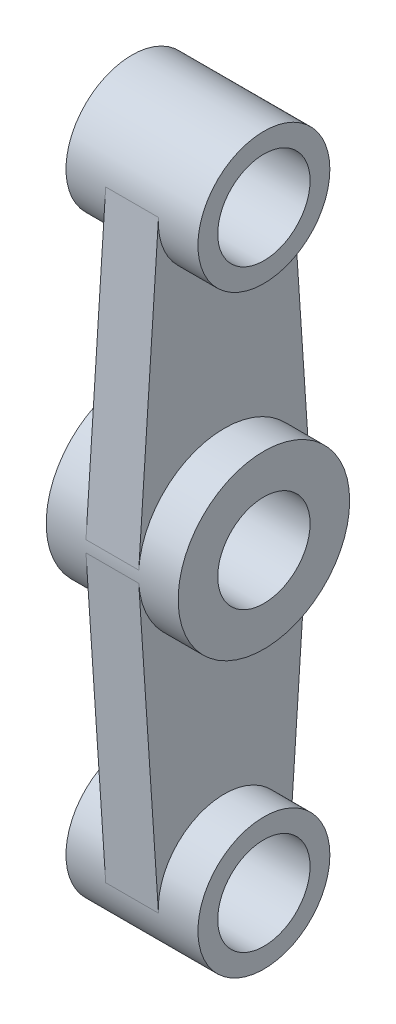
ISO-10303-21;
HEADER;
FILE_DESCRIPTION(('STEP AP214'),'2;1');
FILE_NAME('part.step','',(''),(''),'','','');
FILE_SCHEMA(('AUTOMOTIVE_DESIGN { 1 0 10303 214 1 1 1 1 }'));
ENDSEC;
DATA;
#1=APPLICATION_CONTEXT('core data for automotive mechanical design processes');
#2=APPLICATION_PROTOCOL_DEFINITION('international standard','automotive_design',2000,#1);
#3=PRODUCT_CONTEXT('',#1,'mechanical');
#4=PRODUCT('Part','Part','',(#3));
#5=PRODUCT_RELATED_PRODUCT_CATEGORY('part','',(#4));
#6=PRODUCT_DEFINITION_FORMATION('','',#4);
#7=PRODUCT_DEFINITION_CONTEXT('part definition',#1,'design');
#8=PRODUCT_DEFINITION('design','',#6,#7);
#9=PRODUCT_DEFINITION_SHAPE('','',#8);
#10=(LENGTH_UNIT() NAMED_UNIT(*) SI_UNIT(.MILLI.,.METRE.));
#11=(NAMED_UNIT(*) PLANE_ANGLE_UNIT() SI_UNIT($,.RADIAN.));
#12=(NAMED_UNIT(*) SI_UNIT($,.STERADIAN.) SOLID_ANGLE_UNIT());
#13=UNCERTAINTY_MEASURE_WITH_UNIT(LENGTH_MEASURE(1.E-05),#10,'distance_accuracy_value','');
#14=(GEOMETRIC_REPRESENTATION_CONTEXT(3) GLOBAL_UNCERTAINTY_ASSIGNED_CONTEXT((#13)) GLOBAL_UNIT_ASSIGNED_CONTEXT((#10,
#11,#12)) REPRESENTATION_CONTEXT('',''));
#15=CARTESIAN_POINT('',(0.,0.,0.));
#16=DIRECTION('',(0.,0.,1.));
#17=DIRECTION('',(1.,0.,0.));
#18=AXIS2_PLACEMENT_3D('',#15,#16,#17);
#19=CARTESIAN_POINT('',(10.,-2.16666666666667,32.4276973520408));
#20=DIRECTION('',(0.,0.0666666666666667,-0.997775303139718));
#21=DIRECTION('',(0.,0.997775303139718,0.0666666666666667));
#22=AXIS2_PLACEMENT_3D('',#19,#20,#21);
#23=PLANE('',#22);
#24=DIRECTION('',(0.,-0.997775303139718,-0.0666666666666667));
#25=VECTOR('',#24,1.);
#26=CARTESIAN_POINT('',(-10.,-2.16666666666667,32.4276973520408));
#27=LINE('',#26,#25);
#28=CARTESIAN_POINT('',(-10.,-2.16666666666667,32.4276973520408));
#29=VERTEX_POINT('',#28);
#30=CARTESIAN_POINT('',(-10.,-114.166666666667,24.9443825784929));
#31=VERTEX_POINT('',#30);
#32=EDGE_CURVE('E110',#29,#31,#27,.T.);
#33=ORIENTED_EDGE('',*,*,#32,.T.);
#34=DIRECTION('',(-1.,0.,0.));
#35=VECTOR('',#34,1.);
#36=CARTESIAN_POINT('',(10.,-114.166666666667,24.9443825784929));
#37=LINE('',#36,#35);
#38=CARTESIAN_POINT('',(10.,-114.166666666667,24.9443825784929));
#39=VERTEX_POINT('',#38);
#40=EDGE_CURVE('E44',#39,#31,#37,.T.);
#41=ORIENTED_EDGE('',*,*,#40,.F.);
#42=DIRECTION('',(0.,-0.997775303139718,-0.0666666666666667));
#43=VECTOR('',#42,1.);
#44=CARTESIAN_POINT('',(10.,-2.16666666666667,32.4276973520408));
#45=LINE('',#44,#43);
#46=CARTESIAN_POINT('',(10.,-2.16666666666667,32.4276973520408));
#47=VERTEX_POINT('',#46);
#48=EDGE_CURVE('E126',#47,#39,#45,.T.);
#49=ORIENTED_EDGE('',*,*,#48,.F.);
#50=DIRECTION('',(-1.,0.,0.));
#51=VECTOR('',#50,1.);
#52=CARTESIAN_POINT('',(10.,-2.16666666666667,32.4276973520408));
#53=LINE('',#52,#51);
#54=EDGE_CURVE('E11',#47,#29,#53,.T.);
#55=ORIENTED_EDGE('',*,*,#54,.T.);
#56=EDGE_LOOP('',(#33,#41,#49,#55));
#57=FACE_BOUND('',#56,.T.);
#58=ADVANCED_FACE('F37',(#57),#23,.F.);
#59=CARTESIAN_POINT('',(10.,-2.16666666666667,-32.4276973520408));
#60=DIRECTION('',(0.,-0.0666666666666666,-0.997775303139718));
#61=DIRECTION('',(0.,0.997775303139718,-0.0666666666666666));
#62=AXIS2_PLACEMENT_3D('',#59,#60,#61);
#63=PLANE('',#62);
#64=DIRECTION('',(0.,-0.997775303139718,0.0666666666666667));
#65=VECTOR('',#64,1.);
#66=CARTESIAN_POINT('',(-10.,-2.16666666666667,-32.4276973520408));
#67=LINE('',#66,#65);
#68=CARTESIAN_POINT('',(-10.,-2.16666666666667,-32.4276973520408));
#69=VERTEX_POINT('',#68);
#70=CARTESIAN_POINT('',(-10.,-114.166666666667,-24.944382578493));
#71=VERTEX_POINT('',#70);
#72=EDGE_CURVE('E109',#69,#71,#67,.T.);
#73=ORIENTED_EDGE('',*,*,#72,.F.);
#74=DIRECTION('',(-1.,0.,0.));
#75=VECTOR('',#74,1.);
#76=CARTESIAN_POINT('',(10.,-2.16666666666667,-32.4276973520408));
#77=LINE('',#76,#75);
#78=CARTESIAN_POINT('',(10.,-2.16666666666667,-32.4276973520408));
#79=VERTEX_POINT('',#78);
#80=EDGE_CURVE('E119',#79,#69,#77,.T.);
#81=ORIENTED_EDGE('',*,*,#80,.F.);
#82=DIRECTION('',(0.,-0.997775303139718,0.0666666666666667));
#83=VECTOR('',#82,1.);
#84=CARTESIAN_POINT('',(10.,-2.16666666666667,-32.4276973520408));
#85=LINE('',#84,#83);
#86=CARTESIAN_POINT('',(10.,-114.166666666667,-24.9443825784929));
#87=VERTEX_POINT('',#86);
#88=EDGE_CURVE('E118',#79,#87,#85,.T.);
#89=ORIENTED_EDGE('',*,*,#88,.T.);
#90=DIRECTION('',(-1.,0.,0.));
#91=VECTOR('',#90,1.);
#92=CARTESIAN_POINT('',(10.,-114.166666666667,-24.944382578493));
#93=LINE('',#92,#91);
#94=EDGE_CURVE('E102',#87,#71,#93,.T.);
#95=ORIENTED_EDGE('',*,*,#94,.T.);
#96=EDGE_LOOP('',(#73,#81,#89,#95));
#97=FACE_BOUND('',#96,.T.);
#98=ADVANCED_FACE('F115',(#97),#63,.T.);
#99=CARTESIAN_POINT('',(10.,0.,0.));
#100=DIRECTION('',(1.,0.,0.));
#101=DIRECTION('',(0.,0.,-1.));
#102=AXIS2_PLACEMENT_3D('',#99,#100,#101);
#103=PLANE('',#102);
#104=CARTESIAN_POINT('',(10.,0.,0.));
#105=DIRECTION('',(1.,0.,0.));
#106=DIRECTION('',(0.,0.,-1.));
#107=AXIS2_PLACEMENT_3D('',#104,#105,#106);
#108=CIRCLE('',#107,32.5);
#109=EDGE_CURVE('E124',#47,#79,#108,.T.);
#110=ORIENTED_EDGE('',*,*,#109,.F.);
#111=ORIENTED_EDGE('',*,*,#48,.T.);
#112=CARTESIAN_POINT('',(10.,-112.5,0.));
#113=DIRECTION('',(1.,0.,0.));
#114=DIRECTION('',(0.,0.,-1.));
#115=AXIS2_PLACEMENT_3D('',#112,#113,#114);
#116=CIRCLE('',#115,25.);
#117=EDGE_CURVE('E131',#87,#39,#116,.T.);
#118=ORIENTED_EDGE('',*,*,#117,.F.);
#119=ORIENTED_EDGE('',*,*,#88,.F.);
#120=EDGE_LOOP('',(#110,#111,#118,#119));
#121=FACE_BOUND('',#120,.T.);
#122=ADVANCED_FACE('F144',(#121),#103,.T.);
#123=CARTESIAN_POINT('',(-10.,0.,0.));
#124=DIRECTION('',(1.,0.,0.));
#125=DIRECTION('',(0.,0.,-1.));
#126=AXIS2_PLACEMENT_3D('',#123,#124,#125);
#127=PLANE('',#126);
#128=CARTESIAN_POINT('',(-10.,0.,0.));
#129=DIRECTION('',(1.,0.,0.));
#130=DIRECTION('',(0.,0.,-1.));
#131=AXIS2_PLACEMENT_3D('',#128,#129,#130);
#132=CIRCLE('',#131,32.5);
#133=EDGE_CURVE('E123',#29,#69,#132,.T.);
#134=ORIENTED_EDGE('',*,*,#133,.T.);
#135=ORIENTED_EDGE('',*,*,#72,.T.);
#136=CARTESIAN_POINT('',(-10.,-112.5,0.));
#137=DIRECTION('',(1.,0.,0.));
#138=DIRECTION('',(0.,0.,-1.));
#139=AXIS2_PLACEMENT_3D('',#136,#137,#138);
#140=CIRCLE('',#139,25.);
#141=EDGE_CURVE('E98',#71,#31,#140,.T.);
#142=ORIENTED_EDGE('',*,*,#141,.T.);
#143=ORIENTED_EDGE('',*,*,#32,.F.);
#144=EDGE_LOOP('',(#134,#135,#142,#143));
#145=FACE_BOUND('',#144,.T.);
#146=ADVANCED_FACE('F122',(#145),#127,.F.);
#147=CARTESIAN_POINT('',(25.,0.,0.));
#148=DIRECTION('',(-1.,0.,0.));
#149=DIRECTION('',(0.,0.,1.));
#150=AXIS2_PLACEMENT_3D('',#147,#148,#149);
#151=CYLINDRICAL_SURFACE('',#150,17.5);
#152=CARTESIAN_POINT('',(25.,0.,0.));
#153=DIRECTION('',(1.,0.,0.));
#154=DIRECTION('',(0.,0.,-1.));
#155=AXIS2_PLACEMENT_3D('',#152,#153,#154);
#156=CIRCLE('',#155,17.5);
#157=CARTESIAN_POINT('',(25.,0.,-17.5));
#158=VERTEX_POINT('',#157);
#159=EDGE_CURVE('E149',#158,#158,#156,.T.);
#160=ORIENTED_EDGE('',*,*,#159,.T.);
#161=EDGE_LOOP('',(#160));
#162=FACE_BOUND('',#161,.T.);
#163=CARTESIAN_POINT('',(-25.,0.,0.));
#164=DIRECTION('',(1.,0.,0.));
#165=DIRECTION('',(0.,0.,-1.));
#166=AXIS2_PLACEMENT_3D('',#163,#164,#165);
#167=CIRCLE('',#166,17.5);
#168=CARTESIAN_POINT('',(-25.,0.,-17.5));
#169=VERTEX_POINT('',#168);
#170=EDGE_CURVE('E150',#169,#169,#167,.T.);
#171=ORIENTED_EDGE('',*,*,#170,.F.);
#172=EDGE_LOOP('',(#171));
#173=FACE_BOUND('',#172,.T.);
#174=ADVANCED_FACE('F242',(#162,#173),#151,.F.);
#175=CARTESIAN_POINT('',(25.,0.,0.));
#176=DIRECTION('',(-1.,0.,0.));
#177=DIRECTION('',(0.,0.,1.));
#178=AXIS2_PLACEMENT_3D('',#175,#176,#177);
#179=CYLINDRICAL_SURFACE('',#178,32.5);
#180=DIRECTION('',(-1.,0.,0.));
#181=VECTOR('',#180,1.);
#182=CARTESIAN_POINT('',(10.,2.16666666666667,-32.4276973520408));
#183=LINE('',#182,#181);
#184=CARTESIAN_POINT('',(10.,2.16666666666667,-32.4276973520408));
#185=VERTEX_POINT('',#184);
#186=CARTESIAN_POINT('',(-10.,2.16666666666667,-32.4276973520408));
#187=VERTEX_POINT('',#186);
#188=EDGE_CURVE('E51',#185,#187,#183,.T.);
#189=ORIENTED_EDGE('',*,*,#188,.F.);
#190=CARTESIAN_POINT('',(10.,0.,0.));
#191=DIRECTION('',(1.,0.,0.));
#192=DIRECTION('',(0.,0.,-1.));
#193=AXIS2_PLACEMENT_3D('',#190,#191,#192);
#194=CIRCLE('',#193,32.5);
#195=CARTESIAN_POINT('',(10.,2.16666666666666,32.4276973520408));
#196=VERTEX_POINT('',#195);
#197=EDGE_CURVE('E55',#185,#196,#194,.T.);
#198=ORIENTED_EDGE('',*,*,#197,.T.);
#199=DIRECTION('',(-1.,0.,0.));
#200=VECTOR('',#199,1.);
#201=CARTESIAN_POINT('',(10.,2.16666666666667,32.4276973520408));
#202=LINE('',#201,#200);
#203=CARTESIAN_POINT('',(-10.,2.16666666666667,32.4276973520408));
#204=VERTEX_POINT('',#203);
#205=EDGE_CURVE('E163',#196,#204,#202,.T.);
#206=ORIENTED_EDGE('',*,*,#205,.T.);
#207=CARTESIAN_POINT('',(-10.,0.,0.));
#208=DIRECTION('',(1.,0.,0.));
#209=DIRECTION('',(0.,0.,-1.));
#210=AXIS2_PLACEMENT_3D('',#207,#208,#209);
#211=CIRCLE('',#210,32.5);
#212=EDGE_CURVE('E175',#187,#204,#211,.T.);
#213=ORIENTED_EDGE('',*,*,#212,.F.);
#214=EDGE_LOOP('',(#189,#198,#206,#213));
#215=FACE_BOUND('',#214,.T.);
#216=ORIENTED_EDGE('',*,*,#109,.T.);
#217=ORIENTED_EDGE('',*,*,#80,.T.);
#218=ORIENTED_EDGE('',*,*,#133,.F.);
#219=ORIENTED_EDGE('',*,*,#54,.F.);
#220=EDGE_LOOP('',(#216,#217,#218,#219));
#221=FACE_BOUND('',#220,.T.);
#222=CARTESIAN_POINT('',(25.,0.,0.));
#223=DIRECTION('',(1.,0.,0.));
#224=DIRECTION('',(0.,0.,-1.));
#225=AXIS2_PLACEMENT_3D('',#222,#223,#224);
#226=CIRCLE('',#225,32.5);
#227=CARTESIAN_POINT('',(25.,0.,-32.5));
#228=VERTEX_POINT('',#227);
#229=EDGE_CURVE('E136',#228,#228,#226,.T.);
#230=ORIENTED_EDGE('',*,*,#229,.F.);
#231=EDGE_LOOP('',(#230));
#232=FACE_BOUND('',#231,.T.);
#233=CARTESIAN_POINT('',(-25.,0.,0.));
#234=DIRECTION('',(1.,0.,0.));
#235=DIRECTION('',(0.,0.,-1.));
#236=AXIS2_PLACEMENT_3D('',#233,#234,#235);
#237=CIRCLE('',#236,32.5);
#238=CARTESIAN_POINT('',(-25.,0.,-32.5));
#239=VERTEX_POINT('',#238);
#240=EDGE_CURVE('E146',#239,#239,#237,.T.);
#241=ORIENTED_EDGE('',*,*,#240,.T.);
#242=EDGE_LOOP('',(#241));
#243=FACE_BOUND('',#242,.T.);
#244=ADVANCED_FACE('F141',(#215,#221,#232,#243),#179,.T.);
#245=CARTESIAN_POINT('',(25.,0.,0.));
#246=DIRECTION('',(1.,0.,0.));
#247=DIRECTION('',(0.,0.,-1.));
#248=AXIS2_PLACEMENT_3D('',#245,#246,#247);
#249=PLANE('',#248);
#250=ORIENTED_EDGE('',*,*,#159,.F.);
#251=EDGE_LOOP('',(#250));
#252=FACE_BOUND('',#251,.T.);
#253=ORIENTED_EDGE('',*,*,#229,.T.);
#254=EDGE_LOOP('',(#253));
#255=FACE_BOUND('',#254,.T.);
#256=ADVANCED_FACE('F249',(#252,#255),#249,.T.);
#257=CARTESIAN_POINT('',(-25.,0.,0.));
#258=DIRECTION('',(1.,0.,0.));
#259=DIRECTION('',(0.,0.,-1.));
#260=AXIS2_PLACEMENT_3D('',#257,#258,#259);
#261=PLANE('',#260);
#262=ORIENTED_EDGE('',*,*,#170,.T.);
#263=EDGE_LOOP('',(#262));
#264=FACE_BOUND('',#263,.T.);
#265=ORIENTED_EDGE('',*,*,#240,.F.);
#266=EDGE_LOOP('',(#265));
#267=FACE_BOUND('',#266,.T.);
#268=ADVANCED_FACE('F250',(#264,#267),#261,.F.);
#269=CARTESIAN_POINT('',(10.,2.16666666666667,-32.4276973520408));
#270=DIRECTION('',(0.,0.0666666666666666,-0.997775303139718));
#271=DIRECTION('',(0.,0.997775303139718,0.0666666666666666));
#272=AXIS2_PLACEMENT_3D('',#269,#270,#271);
#273=PLANE('',#272);
#274=DIRECTION('',(0.,-0.997775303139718,-0.0666666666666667));
#275=VECTOR('',#274,1.);
#276=CARTESIAN_POINT('',(-10.,2.16666666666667,-32.4276973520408));
#277=LINE('',#276,#275);
#278=CARTESIAN_POINT('',(-10.,114.166666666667,-24.944382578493));
#279=VERTEX_POINT('',#278);
#280=EDGE_CURVE('E172',#279,#187,#277,.T.);
#281=ORIENTED_EDGE('',*,*,#280,.F.);
#282=DIRECTION('',(-1.,0.,0.));
#283=VECTOR('',#282,1.);
#284=CARTESIAN_POINT('',(10.,114.166666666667,-24.944382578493));
#285=LINE('',#284,#283);
#286=CARTESIAN_POINT('',(10.,114.166666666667,-24.9443825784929));
#287=VERTEX_POINT('',#286);
#288=EDGE_CURVE('E158',#287,#279,#285,.T.);
#289=ORIENTED_EDGE('',*,*,#288,.F.);
#290=DIRECTION('',(0.,-0.997775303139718,-0.0666666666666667));
#291=VECTOR('',#290,1.);
#292=CARTESIAN_POINT('',(10.,2.16666666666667,-32.4276973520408));
#293=LINE('',#292,#291);
#294=EDGE_CURVE('E182',#287,#185,#293,.T.);
#295=ORIENTED_EDGE('',*,*,#294,.T.);
#296=ORIENTED_EDGE('',*,*,#188,.T.);
#297=EDGE_LOOP('',(#281,#289,#295,#296));
#298=FACE_BOUND('',#297,.T.);
#299=ADVANCED_FACE('F253',(#298),#273,.T.);
#300=CARTESIAN_POINT('',(10.,2.16666666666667,32.4276973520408));
#301=DIRECTION('',(0.,-0.0666666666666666,-0.997775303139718));
#302=DIRECTION('',(0.,0.997775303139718,-0.0666666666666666));
#303=AXIS2_PLACEMENT_3D('',#300,#301,#302);
#304=PLANE('',#303);
#305=DIRECTION('',(0.,-0.997775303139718,0.0666666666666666));
#306=VECTOR('',#305,1.);
#307=CARTESIAN_POINT('',(-10.,2.16666666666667,32.4276973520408));
#308=LINE('',#307,#306);
#309=CARTESIAN_POINT('',(-10.,114.166666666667,24.944382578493));
#310=VERTEX_POINT('',#309);
#311=EDGE_CURVE('E166',#310,#204,#308,.T.);
#312=ORIENTED_EDGE('',*,*,#311,.T.);
#313=ORIENTED_EDGE('',*,*,#205,.F.);
#314=DIRECTION('',(0.,-0.997775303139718,0.0666666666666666));
#315=VECTOR('',#314,1.);
#316=CARTESIAN_POINT('',(10.,2.16666666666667,32.4276973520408));
#317=LINE('',#316,#315);
#318=CARTESIAN_POINT('',(10.,114.166666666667,24.944382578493));
#319=VERTEX_POINT('',#318);
#320=EDGE_CURVE('E165',#319,#196,#317,.T.);
#321=ORIENTED_EDGE('',*,*,#320,.F.);
#322=DIRECTION('',(-1.,0.,0.));
#323=VECTOR('',#322,1.);
#324=CARTESIAN_POINT('',(10.,114.166666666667,24.944382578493));
#325=LINE('',#324,#323);
#326=EDGE_CURVE('E160',#319,#310,#325,.T.);
#327=ORIENTED_EDGE('',*,*,#326,.T.);
#328=EDGE_LOOP('',(#312,#313,#321,#327));
#329=FACE_BOUND('',#328,.T.);
#330=ADVANCED_FACE('F260',(#329),#304,.F.);
#331=CARTESIAN_POINT('',(10.,0.,0.));
#332=DIRECTION('',(1.,0.,0.));
#333=DIRECTION('',(0.,0.,-1.));
#334=AXIS2_PLACEMENT_3D('',#331,#332,#333);
#335=PLANE('',#334);
#336=ORIENTED_EDGE('',*,*,#197,.F.);
#337=ORIENTED_EDGE('',*,*,#294,.F.);
#338=CARTESIAN_POINT('',(10.,112.5,0.));
#339=DIRECTION('',(1.,0.,0.));
#340=DIRECTION('',(0.,0.,-1.));
#341=AXIS2_PLACEMENT_3D('',#338,#339,#340);
#342=CIRCLE('',#341,25.);
#343=EDGE_CURVE('E180',#319,#287,#342,.T.);
#344=ORIENTED_EDGE('',*,*,#343,.F.);
#345=ORIENTED_EDGE('',*,*,#320,.T.);
#346=EDGE_LOOP('',(#336,#337,#344,#345));
#347=FACE_BOUND('',#346,.T.);
#348=ADVANCED_FACE('F264',(#347),#335,.T.);
#349=CARTESIAN_POINT('',(-10.,0.,0.));
#350=DIRECTION('',(1.,0.,0.));
#351=DIRECTION('',(0.,0.,-1.));
#352=AXIS2_PLACEMENT_3D('',#349,#350,#351);
#353=PLANE('',#352);
#354=ORIENTED_EDGE('',*,*,#212,.T.);
#355=ORIENTED_EDGE('',*,*,#311,.F.);
#356=CARTESIAN_POINT('',(-10.,112.5,0.));
#357=DIRECTION('',(1.,0.,0.));
#358=DIRECTION('',(0.,0.,-1.));
#359=AXIS2_PLACEMENT_3D('',#356,#357,#358);
#360=CIRCLE('',#359,25.);
#361=EDGE_CURVE('E169',#310,#279,#360,.T.);
#362=ORIENTED_EDGE('',*,*,#361,.T.);
#363=ORIENTED_EDGE('',*,*,#280,.T.);
#364=EDGE_LOOP('',(#354,#355,#362,#363));
#365=FACE_BOUND('',#364,.T.);
#366=ADVANCED_FACE('F266',(#365),#353,.F.);
#367=CARTESIAN_POINT('',(25.,112.5,0.));
#368=DIRECTION('',(-1.,0.,0.));
#369=DIRECTION('',(0.,0.,1.));
#370=AXIS2_PLACEMENT_3D('',#367,#368,#369);
#371=CYLINDRICAL_SURFACE('',#370,17.5);
#372=CARTESIAN_POINT('',(25.,112.5,0.));
#373=DIRECTION('',(1.,0.,0.));
#374=DIRECTION('',(0.,0.,-1.));
#375=AXIS2_PLACEMENT_3D('',#372,#373,#374);
#376=CIRCLE('',#375,17.5);
#377=CARTESIAN_POINT('',(25.,112.5,-17.5));
#378=VERTEX_POINT('',#377);
#379=EDGE_CURVE('E189',#378,#378,#376,.T.);
#380=ORIENTED_EDGE('',*,*,#379,.T.);
#381=EDGE_LOOP('',(#380));
#382=FACE_BOUND('',#381,.T.);
#383=CARTESIAN_POINT('',(-25.,112.5,0.));
#384=DIRECTION('',(1.,0.,0.));
#385=DIRECTION('',(0.,0.,-1.));
#386=AXIS2_PLACEMENT_3D('',#383,#384,#385);
#387=CIRCLE('',#386,17.5);
#388=CARTESIAN_POINT('',(-25.,112.5,-17.5));
#389=VERTEX_POINT('',#388);
#390=EDGE_CURVE('E190',#389,#389,#387,.T.);
#391=ORIENTED_EDGE('',*,*,#390,.F.);
#392=EDGE_LOOP('',(#391));
#393=FACE_BOUND('',#392,.T.);
#394=ADVANCED_FACE('F269',(#382,#393),#371,.F.);
#395=CARTESIAN_POINT('',(25.,112.5,0.));
#396=DIRECTION('',(-1.,0.,0.));
#397=DIRECTION('',(0.,0.,1.));
#398=AXIS2_PLACEMENT_3D('',#395,#396,#397);
#399=CYLINDRICAL_SURFACE('',#398,25.);
#400=ORIENTED_EDGE('',*,*,#343,.T.);
#401=ORIENTED_EDGE('',*,*,#288,.T.);
#402=ORIENTED_EDGE('',*,*,#361,.F.);
#403=ORIENTED_EDGE('',*,*,#326,.F.);
#404=EDGE_LOOP('',(#400,#401,#402,#403));
#405=FACE_BOUND('',#404,.T.);
#406=CARTESIAN_POINT('',(25.,112.5,0.));
#407=DIRECTION('',(1.,0.,0.));
#408=DIRECTION('',(0.,0.,-1.));
#409=AXIS2_PLACEMENT_3D('',#406,#407,#408);
#410=CIRCLE('',#409,25.);
#411=CARTESIAN_POINT('',(25.,112.5,-25.));
#412=VERTEX_POINT('',#411);
#413=EDGE_CURVE('E178',#412,#412,#410,.T.);
#414=ORIENTED_EDGE('',*,*,#413,.F.);
#415=EDGE_LOOP('',(#414));
#416=FACE_BOUND('',#415,.T.);
#417=CARTESIAN_POINT('',(-25.,112.5,0.));
#418=DIRECTION('',(1.,0.,0.));
#419=DIRECTION('',(0.,0.,-1.));
#420=AXIS2_PLACEMENT_3D('',#417,#418,#419);
#421=CIRCLE('',#420,25.);
#422=CARTESIAN_POINT('',(-25.,112.5,-25.));
#423=VERTEX_POINT('',#422);
#424=EDGE_CURVE('E186',#423,#423,#421,.T.);
#425=ORIENTED_EDGE('',*,*,#424,.T.);
#426=EDGE_LOOP('',(#425));
#427=FACE_BOUND('',#426,.T.);
#428=ADVANCED_FACE('F276',(#405,#416,#427),#399,.T.);
#429=CARTESIAN_POINT('',(25.,0.,0.));
#430=DIRECTION('',(1.,0.,0.));
#431=DIRECTION('',(0.,0.,-1.));
#432=AXIS2_PLACEMENT_3D('',#429,#430,#431);
#433=PLANE('',#432);
#434=ORIENTED_EDGE('',*,*,#379,.F.);
#435=EDGE_LOOP('',(#434));
#436=FACE_BOUND('',#435,.T.);
#437=ORIENTED_EDGE('',*,*,#413,.T.);
#438=EDGE_LOOP('',(#437));
#439=FACE_BOUND('',#438,.T.);
#440=ADVANCED_FACE('F280',(#436,#439),#433,.T.);
#441=CARTESIAN_POINT('',(-25.,0.,0.));
#442=DIRECTION('',(1.,0.,0.));
#443=DIRECTION('',(0.,0.,-1.));
#444=AXIS2_PLACEMENT_3D('',#441,#442,#443);
#445=PLANE('',#444);
#446=ORIENTED_EDGE('',*,*,#390,.T.);
#447=EDGE_LOOP('',(#446));
#448=FACE_BOUND('',#447,.T.);
#449=ORIENTED_EDGE('',*,*,#424,.F.);
#450=EDGE_LOOP('',(#449));
#451=FACE_BOUND('',#450,.T.);
#452=ADVANCED_FACE('F215',(#448,#451),#445,.F.);
#453=CARTESIAN_POINT('',(25.,-112.5,0.));
#454=DIRECTION('',(-1.,0.,0.));
#455=DIRECTION('',(0.,0.,1.));
#456=AXIS2_PLACEMENT_3D('',#453,#454,#455);
#457=CYLINDRICAL_SURFACE('',#456,25.);
#458=ORIENTED_EDGE('',*,*,#117,.T.);
#459=ORIENTED_EDGE('',*,*,#40,.T.);
#460=ORIENTED_EDGE('',*,*,#141,.F.);
#461=ORIENTED_EDGE('',*,*,#94,.F.);
#462=EDGE_LOOP('',(#458,#459,#460,#461));
#463=FACE_BOUND('',#462,.T.);
#464=CARTESIAN_POINT('',(25.,-112.5,0.));
#465=DIRECTION('',(1.,0.,0.));
#466=DIRECTION('',(0.,0.,-1.));
#467=AXIS2_PLACEMENT_3D('',#464,#465,#466);
#468=CIRCLE('',#467,25.);
#469=CARTESIAN_POINT('',(25.,-112.5,-25.));
#470=VERTEX_POINT('',#469);
#471=EDGE_CURVE('E201',#470,#470,#468,.T.);
#472=ORIENTED_EDGE('',*,*,#471,.F.);
#473=EDGE_LOOP('',(#472));
#474=FACE_BOUND('',#473,.T.);
#475=CARTESIAN_POINT('',(-25.,-112.5,0.));
#476=DIRECTION('',(1.,0.,0.));
#477=DIRECTION('',(0.,0.,-1.));
#478=AXIS2_PLACEMENT_3D('',#475,#476,#477);
#479=CIRCLE('',#478,25.);
#480=CARTESIAN_POINT('',(-25.,-112.5,-25.));
#481=VERTEX_POINT('',#480);
#482=EDGE_CURVE('E202',#481,#481,#479,.T.);
#483=ORIENTED_EDGE('',*,*,#482,.T.);
#484=EDGE_LOOP('',(#483));
#485=FACE_BOUND('',#484,.T.);
#486=ADVANCED_FACE('F100',(#463,#474,#485),#457,.T.);
#487=CARTESIAN_POINT('',(25.,-112.5,0.));
#488=DIRECTION('',(-1.,0.,0.));
#489=DIRECTION('',(0.,0.,1.));
#490=AXIS2_PLACEMENT_3D('',#487,#488,#489);
#491=CYLINDRICAL_SURFACE('',#490,17.5);
#492=CARTESIAN_POINT('',(25.,-112.5,0.));
#493=DIRECTION('',(1.,0.,0.));
#494=DIRECTION('',(0.,0.,-1.));
#495=AXIS2_PLACEMENT_3D('',#492,#493,#494);
#496=CIRCLE('',#495,17.5);
#497=CARTESIAN_POINT('',(25.,-112.5,-17.5));
#498=VERTEX_POINT('',#497);
#499=EDGE_CURVE('E193',#498,#498,#496,.T.);
#500=ORIENTED_EDGE('',*,*,#499,.T.);
#501=EDGE_LOOP('',(#500));
#502=FACE_BOUND('',#501,.T.);
#503=CARTESIAN_POINT('',(-25.,-112.5,0.));
#504=DIRECTION('',(1.,0.,0.));
#505=DIRECTION('',(0.,0.,-1.));
#506=AXIS2_PLACEMENT_3D('',#503,#504,#505);
#507=CIRCLE('',#506,17.5);
#508=CARTESIAN_POINT('',(-25.,-112.5,-17.5));
#509=VERTEX_POINT('',#508);
#510=EDGE_CURVE('E198',#509,#509,#507,.T.);
#511=ORIENTED_EDGE('',*,*,#510,.F.);
#512=EDGE_LOOP('',(#511));
#513=FACE_BOUND('',#512,.T.);
#514=ADVANCED_FACE('F214',(#502,#513),#491,.F.);
#515=CARTESIAN_POINT('',(25.,0.,0.));
#516=DIRECTION('',(1.,0.,0.));
#517=DIRECTION('',(0.,0.,-1.));
#518=AXIS2_PLACEMENT_3D('',#515,#516,#517);
#519=PLANE('',#518);
#520=ORIENTED_EDGE('',*,*,#471,.T.);
#521=EDGE_LOOP('',(#520));
#522=FACE_BOUND('',#521,.T.);
#523=ORIENTED_EDGE('',*,*,#499,.F.);
#524=EDGE_LOOP('',(#523));
#525=FACE_BOUND('',#524,.T.);
#526=ADVANCED_FACE('F210',(#522,#525),#519,.T.);
#527=CARTESIAN_POINT('',(-25.,0.,0.));
#528=DIRECTION('',(1.,0.,0.));
#529=DIRECTION('',(0.,0.,-1.));
#530=AXIS2_PLACEMENT_3D('',#527,#528,#529);
#531=PLANE('',#530);
#532=ORIENTED_EDGE('',*,*,#482,.F.);
#533=EDGE_LOOP('',(#532));
#534=FACE_BOUND('',#533,.T.);
#535=ORIENTED_EDGE('',*,*,#510,.T.);
#536=EDGE_LOOP('',(#535));
#537=FACE_BOUND('',#536,.T.);
#538=ADVANCED_FACE('F219',(#534,#537),#531,.F.);
#539=CLOSED_SHELL('',(#58,#98,#122,#146,#174,#244,#256,#268,#299,#330,#348,#366,#394,#428,#440,
#452,#486,#514,#526,#538));
#540=MANIFOLD_SOLID_BREP('B2',#539);
#541=ADVANCED_BREP_SHAPE_REPRESENTATION('',(#18,#540),#14);
#542=SHAPE_DEFINITION_REPRESENTATION(#9,#541);
ENDSEC;
END-ISO-10303-21;
